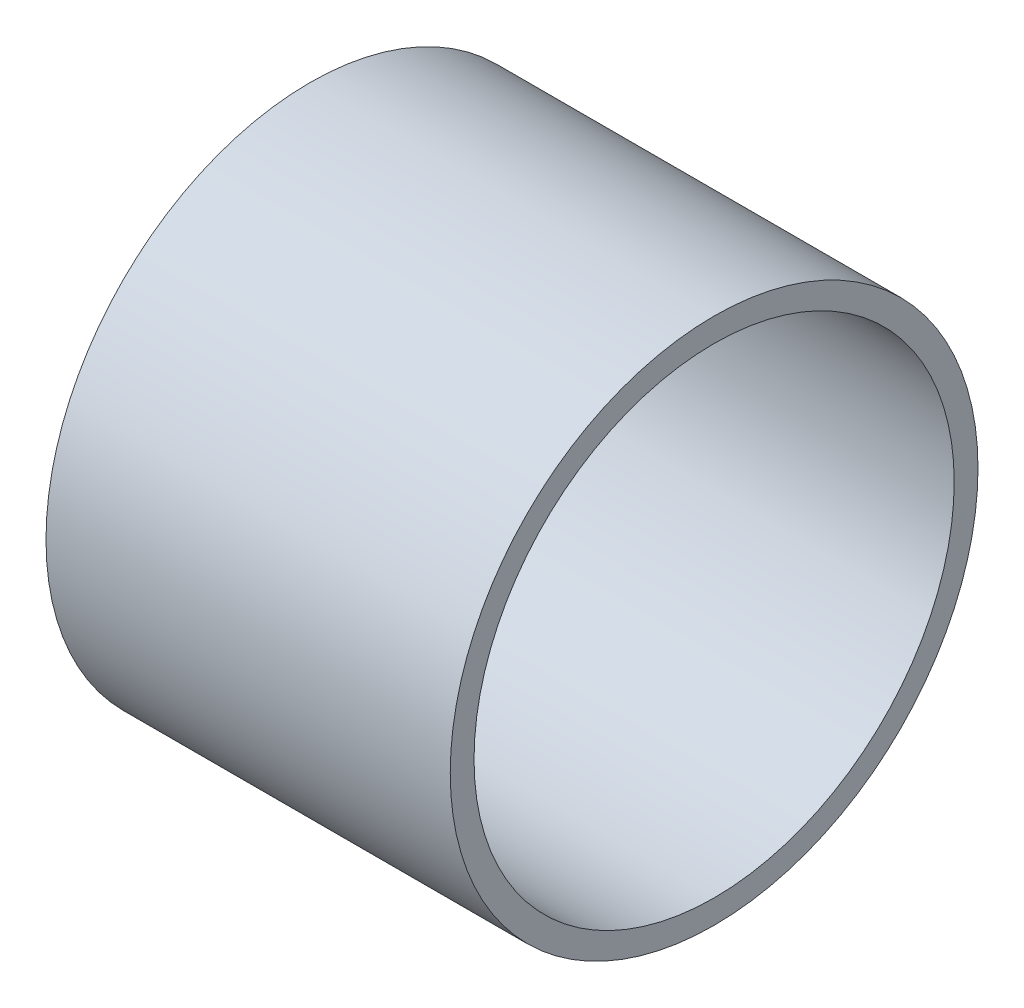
from build123d import *

# Parameters (mm, degrees)
ESQUISSE1_R        = 69.85
ESQUISSE1_R_2      = 63.55
EXTRU_MINCE1_DEPTH = 107


with BuildPart() as part:
    # Esquisse1 → Extru.-Mince1 (new body)
    with BuildSketch(Plane(origin=(800, 0, 0), x_dir=(0, 0, -1), z_dir=(1, 0, 0))):
        with Locations((0, -7.906902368)):
            Circle(ESQUISSE1_R)
        with Locations((0, -7.906902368)):
            Circle(ESQUISSE1_R_2, mode=Mode.SUBTRACT)
    extrude(amount=-EXTRU_MINCE1_DEPTH)


solid = part.part
